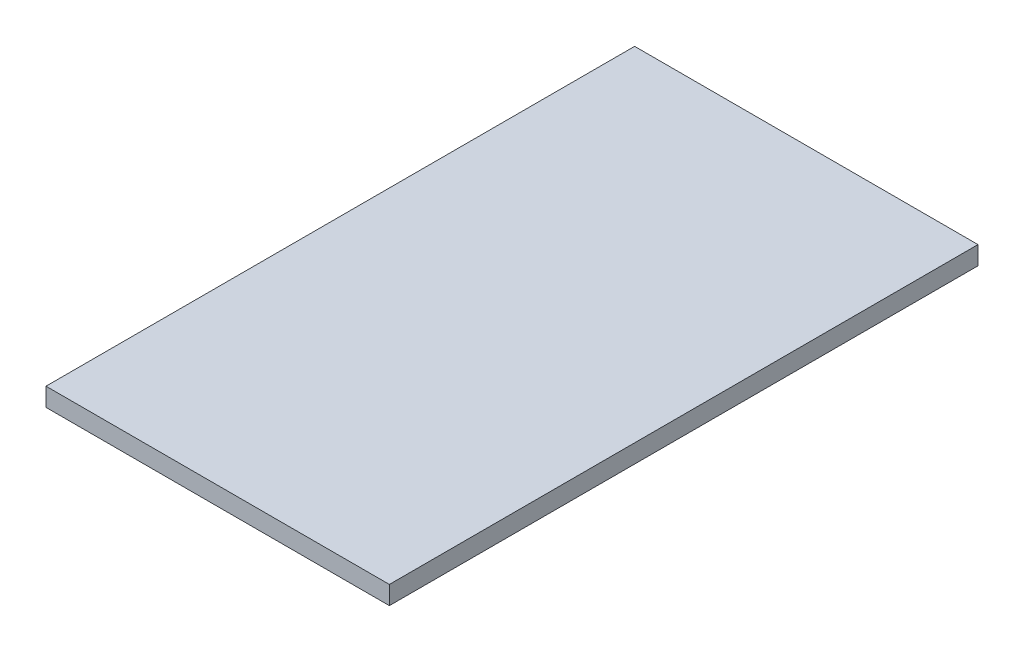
ISO-10303-21;
HEADER;
FILE_DESCRIPTION(('STEP AP214'),'2;1');
FILE_NAME('part.step','',(''),(''),'','','');
FILE_SCHEMA(('AUTOMOTIVE_DESIGN { 1 0 10303 214 1 1 1 1 }'));
ENDSEC;
DATA;
#1=APPLICATION_CONTEXT('core data for automotive mechanical design processes');
#2=APPLICATION_PROTOCOL_DEFINITION('international standard','automotive_design',2000,#1);
#3=PRODUCT_CONTEXT('',#1,'mechanical');
#4=PRODUCT('Part','Part','',(#3));
#5=PRODUCT_RELATED_PRODUCT_CATEGORY('part','',(#4));
#6=PRODUCT_DEFINITION_FORMATION('','',#4);
#7=PRODUCT_DEFINITION_CONTEXT('part definition',#1,'design');
#8=PRODUCT_DEFINITION('design','',#6,#7);
#9=PRODUCT_DEFINITION_SHAPE('','',#8);
#10=(LENGTH_UNIT() NAMED_UNIT(*) SI_UNIT(.MILLI.,.METRE.));
#11=(NAMED_UNIT(*) PLANE_ANGLE_UNIT() SI_UNIT($,.RADIAN.));
#12=(NAMED_UNIT(*) SI_UNIT($,.STERADIAN.) SOLID_ANGLE_UNIT());
#13=UNCERTAINTY_MEASURE_WITH_UNIT(LENGTH_MEASURE(1.E-05),#10,'distance_accuracy_value','');
#14=(GEOMETRIC_REPRESENTATION_CONTEXT(3) GLOBAL_UNCERTAINTY_ASSIGNED_CONTEXT((#13)) GLOBAL_UNIT_ASSIGNED_CONTEXT((#10,
#11,#12)) REPRESENTATION_CONTEXT('',''));
#15=CARTESIAN_POINT('',(0.,0.,0.));
#16=DIRECTION('',(0.,0.,1.));
#17=DIRECTION('',(1.,0.,0.));
#18=AXIS2_PLACEMENT_3D('',#15,#16,#17);
#19=CARTESIAN_POINT('',(0.,4.7625,0.));
#20=DIRECTION('',(1.,0.,0.));
#21=DIRECTION('',(0.,0.,-1.));
#22=AXIS2_PLACEMENT_3D('',#19,#20,#21);
#23=PLANE('',#22);
#24=DIRECTION('',(0.,0.,1.));
#25=VECTOR('',#24,1.);
#26=CARTESIAN_POINT('',(0.,0.,0.));
#27=LINE('',#26,#25);
#28=CARTESIAN_POINT('',(0.,0.,-152.4));
#29=VERTEX_POINT('',#28);
#30=CARTESIAN_POINT('',(0.,0.,0.));
#31=VERTEX_POINT('',#30);
#32=EDGE_CURVE('E96',#29,#31,#27,.T.);
#33=ORIENTED_EDGE('',*,*,#32,.T.);
#34=DIRECTION('',(0.,-1.,0.));
#35=VECTOR('',#34,1.);
#36=CARTESIAN_POINT('',(0.,4.7625,0.));
#37=LINE('',#36,#35);
#38=CARTESIAN_POINT('',(0.,4.7625,0.));
#39=VERTEX_POINT('',#38);
#40=EDGE_CURVE('E11',#39,#31,#37,.T.);
#41=ORIENTED_EDGE('',*,*,#40,.F.);
#42=DIRECTION('',(0.,0.,1.));
#43=VECTOR('',#42,1.);
#44=CARTESIAN_POINT('',(0.,4.7625,0.));
#45=LINE('',#44,#43);
#46=CARTESIAN_POINT('',(0.,4.7625,-152.4));
#47=VERTEX_POINT('',#46);
#48=EDGE_CURVE('E84',#47,#39,#45,.T.);
#49=ORIENTED_EDGE('',*,*,#48,.F.);
#50=DIRECTION('',(0.,-1.,0.));
#51=VECTOR('',#50,1.);
#52=CARTESIAN_POINT('',(0.,4.7625,-152.4));
#53=LINE('',#52,#51);
#54=EDGE_CURVE('E92',#47,#29,#53,.T.);
#55=ORIENTED_EDGE('',*,*,#54,.T.);
#56=EDGE_LOOP('',(#33,#41,#49,#55));
#57=FACE_BOUND('',#56,.T.);
#58=ADVANCED_FACE('F33',(#57),#23,.F.);
#59=CARTESIAN_POINT('',(0.,4.7625,0.));
#60=DIRECTION('',(0.,0.,-1.));
#61=DIRECTION('',(-1.,0.,0.));
#62=AXIS2_PLACEMENT_3D('',#59,#60,#61);
#63=PLANE('',#62);
#64=DIRECTION('',(1.,0.,0.));
#65=VECTOR('',#64,1.);
#66=CARTESIAN_POINT('',(0.,0.,0.));
#67=LINE('',#66,#65);
#68=CARTESIAN_POINT('',(88.9,0.,0.));
#69=VERTEX_POINT('',#68);
#70=EDGE_CURVE('E88',#31,#69,#67,.T.);
#71=ORIENTED_EDGE('',*,*,#70,.T.);
#72=DIRECTION('',(0.,-1.,0.));
#73=VECTOR('',#72,1.);
#74=CARTESIAN_POINT('',(88.9,4.7625,0.));
#75=LINE('',#74,#73);
#76=CARTESIAN_POINT('',(88.9,4.7625,0.));
#77=VERTEX_POINT('',#76);
#78=EDGE_CURVE('E41',#77,#69,#75,.T.);
#79=ORIENTED_EDGE('',*,*,#78,.F.);
#80=DIRECTION('',(1.,0.,0.));
#81=VECTOR('',#80,1.);
#82=CARTESIAN_POINT('',(0.,4.7625,0.));
#83=LINE('',#82,#81);
#84=EDGE_CURVE('E79',#39,#77,#83,.T.);
#85=ORIENTED_EDGE('',*,*,#84,.F.);
#86=ORIENTED_EDGE('',*,*,#40,.T.);
#87=EDGE_LOOP('',(#71,#79,#85,#86));
#88=FACE_BOUND('',#87,.T.);
#89=ADVANCED_FACE('F87',(#88),#63,.F.);
#90=CARTESIAN_POINT('',(88.9,4.7625,0.));
#91=DIRECTION('',(-1.,0.,0.));
#92=DIRECTION('',(0.,0.,1.));
#93=AXIS2_PLACEMENT_3D('',#90,#91,#92);
#94=PLANE('',#93);
#95=DIRECTION('',(0.,0.,-1.));
#96=VECTOR('',#95,1.);
#97=CARTESIAN_POINT('',(88.9,0.,0.));
#98=LINE('',#97,#96);
#99=CARTESIAN_POINT('',(88.9,0.,-152.4));
#100=VERTEX_POINT('',#99);
#101=EDGE_CURVE('E66',#69,#100,#98,.T.);
#102=ORIENTED_EDGE('',*,*,#101,.T.);
#103=DIRECTION('',(0.,-1.,0.));
#104=VECTOR('',#103,1.);
#105=CARTESIAN_POINT('',(88.9,4.7625,-152.4));
#106=LINE('',#105,#104);
#107=CARTESIAN_POINT('',(88.9,4.7625,-152.4));
#108=VERTEX_POINT('',#107);
#109=EDGE_CURVE('E89',#108,#100,#106,.T.);
#110=ORIENTED_EDGE('',*,*,#109,.F.);
#111=DIRECTION('',(0.,0.,-1.));
#112=VECTOR('',#111,1.);
#113=CARTESIAN_POINT('',(88.9,4.7625,0.));
#114=LINE('',#113,#112);
#115=EDGE_CURVE('E82',#77,#108,#114,.T.);
#116=ORIENTED_EDGE('',*,*,#115,.F.);
#117=ORIENTED_EDGE('',*,*,#78,.T.);
#118=EDGE_LOOP('',(#102,#110,#116,#117));
#119=FACE_BOUND('',#118,.T.);
#120=ADVANCED_FACE('F90',(#119),#94,.F.);
#121=CARTESIAN_POINT('',(0.,4.7625,-152.4));
#122=DIRECTION('',(0.,0.,1.));
#123=DIRECTION('',(1.,0.,0.));
#124=AXIS2_PLACEMENT_3D('',#121,#122,#123);
#125=PLANE('',#124);
#126=DIRECTION('',(-1.,0.,0.));
#127=VECTOR('',#126,1.);
#128=CARTESIAN_POINT('',(0.,0.,-152.4));
#129=LINE('',#128,#127);
#130=EDGE_CURVE('E72',#100,#29,#129,.T.);
#131=ORIENTED_EDGE('',*,*,#130,.T.);
#132=ORIENTED_EDGE('',*,*,#54,.F.);
#133=DIRECTION('',(-1.,0.,0.));
#134=VECTOR('',#133,1.);
#135=CARTESIAN_POINT('',(0.,4.7625,-152.4));
#136=LINE('',#135,#134);
#137=EDGE_CURVE('E49',#108,#47,#136,.T.);
#138=ORIENTED_EDGE('',*,*,#137,.F.);
#139=ORIENTED_EDGE('',*,*,#109,.T.);
#140=EDGE_LOOP('',(#131,#132,#138,#139));
#141=FACE_BOUND('',#140,.T.);
#142=ADVANCED_FACE('F103',(#141),#125,.F.);
#143=CARTESIAN_POINT('',(0.,4.7625,0.));
#144=DIRECTION('',(0.,-1.,0.));
#145=DIRECTION('',(0.,0.,-1.));
#146=AXIS2_PLACEMENT_3D('',#143,#144,#145);
#147=PLANE('',#146);
#148=ORIENTED_EDGE('',*,*,#48,.T.);
#149=ORIENTED_EDGE('',*,*,#84,.T.);
#150=ORIENTED_EDGE('',*,*,#115,.T.);
#151=ORIENTED_EDGE('',*,*,#137,.T.);
#152=EDGE_LOOP('',(#148,#149,#150,#151));
#153=FACE_BOUND('',#152,.T.);
#154=ADVANCED_FACE('F80',(#153),#147,.F.);
#155=CARTESIAN_POINT('',(0.,0.,0.));
#156=DIRECTION('',(0.,-1.,0.));
#157=DIRECTION('',(0.,0.,-1.));
#158=AXIS2_PLACEMENT_3D('',#155,#156,#157);
#159=PLANE('',#158);
#160=ORIENTED_EDGE('',*,*,#32,.F.);
#161=ORIENTED_EDGE('',*,*,#130,.F.);
#162=ORIENTED_EDGE('',*,*,#101,.F.);
#163=ORIENTED_EDGE('',*,*,#70,.F.);
#164=EDGE_LOOP('',(#160,#161,#162,#163));
#165=FACE_BOUND('',#164,.T.);
#166=ADVANCED_FACE('F106',(#165),#159,.T.);
#167=CLOSED_SHELL('',(#58,#89,#120,#142,#154,#166));
#168=MANIFOLD_SOLID_BREP('B2',#167);
#169=ADVANCED_BREP_SHAPE_REPRESENTATION('',(#18,#168),#14);
#170=SHAPE_DEFINITION_REPRESENTATION(#9,#169);
ENDSEC;
END-ISO-10303-21;
